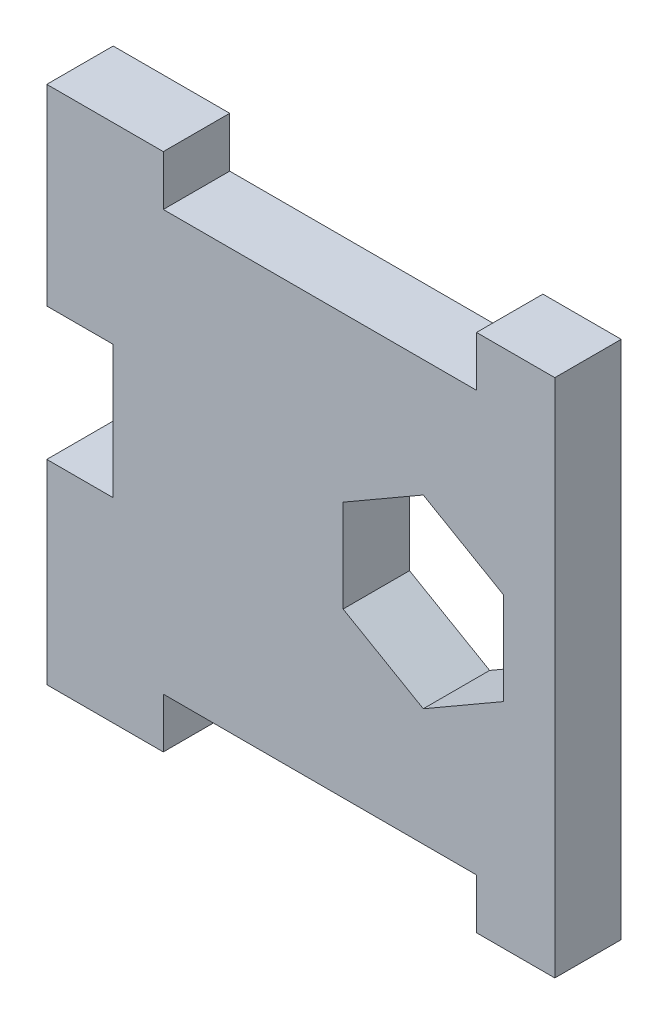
from build123d import *

# Parameters (mm, degrees)
BOSS_EXTRUDE1_DEPTH = 5.3848


with BuildPart() as part:
    # Sketch2 → Boss-Extrude1 (new body)
    with BuildSketch(Plane.XY.offset(-7.197432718)):
        Polygon((598.468256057, -739.3025483), (607.917056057, -739.3025483), (607.917056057, -735.2385483), (633.31705606, -735.2385483), (633.31705606, -739.3025483), (639.667056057, -739.3025483), (639.667056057, -697.138548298), (633.31705606, -697.138548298), (633.31705606, -701.202548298), (607.917056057, -701.202548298), (607.917056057, -697.138548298), (598.468256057, -697.138548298), (598.468256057, -712.7087483), (603.853056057, -712.7087483), (603.853056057, -718.0935483), (603.853056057, -723.4783483), (598.468256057, -723.4783483), align=None)
        Polygon((628.999056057, -725.726101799), (635.499056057, -721.97332505), (635.499056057, -714.46777155), (628.999056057, -710.7149948), (622.499056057, -714.46777155), (622.499056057, -721.97332505), align=None, mode=Mode.SUBTRACT)
    extrude(amount=BOSS_EXTRUDE1_DEPTH)


solid = part.part
